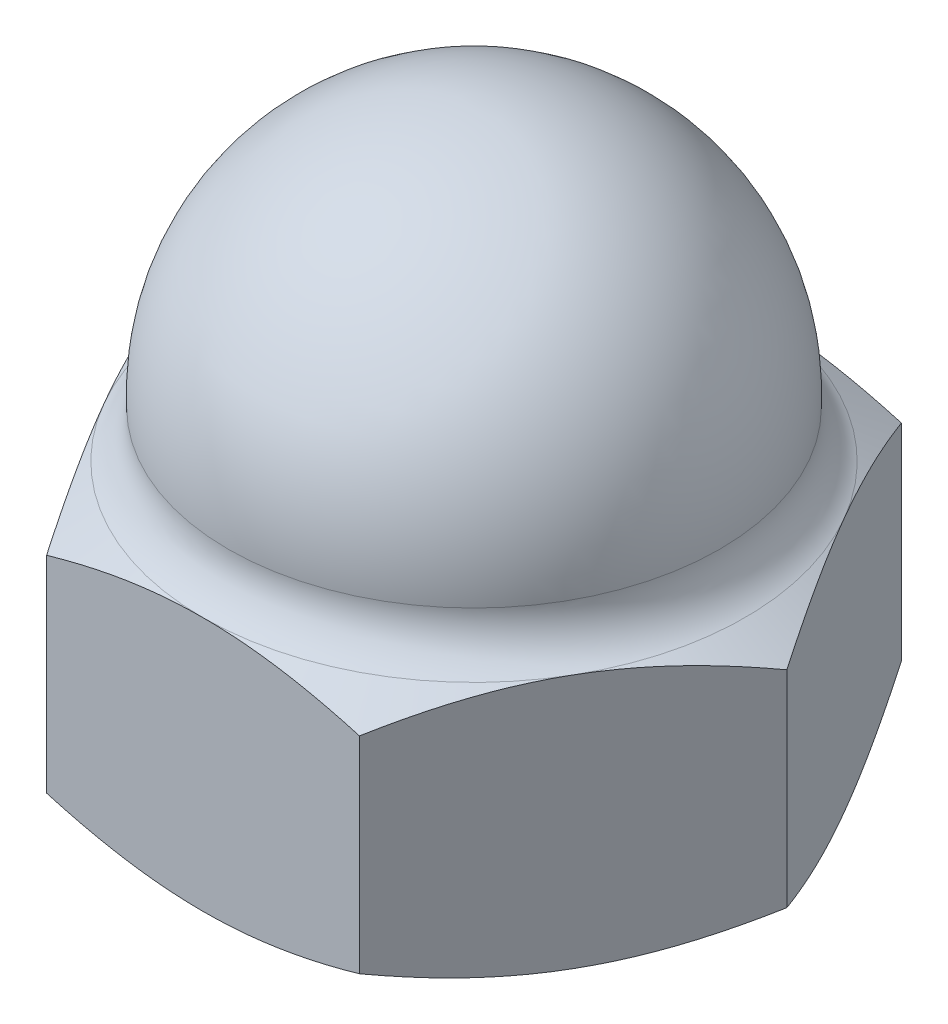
ISO-10303-21;
HEADER;
FILE_DESCRIPTION(('STEP AP214'),'2;1');
FILE_NAME('part.step','',(''),(''),'','','');
FILE_SCHEMA(('AUTOMOTIVE_DESIGN { 1 0 10303 214 1 1 1 1 }'));
ENDSEC;
DATA;
#1=APPLICATION_CONTEXT('core data for automotive mechanical design processes');
#2=APPLICATION_PROTOCOL_DEFINITION('international standard','automotive_design',2000,#1);
#3=PRODUCT_CONTEXT('',#1,'mechanical');
#4=PRODUCT('Part','Part','',(#3));
#5=PRODUCT_RELATED_PRODUCT_CATEGORY('part','',(#4));
#6=PRODUCT_DEFINITION_FORMATION('','',#4);
#7=PRODUCT_DEFINITION_CONTEXT('part definition',#1,'design');
#8=PRODUCT_DEFINITION('design','',#6,#7);
#9=PRODUCT_DEFINITION_SHAPE('','',#8);
#10=(LENGTH_UNIT() NAMED_UNIT(*) SI_UNIT(.MILLI.,.METRE.));
#11=(NAMED_UNIT(*) PLANE_ANGLE_UNIT() SI_UNIT($,.RADIAN.));
#12=(NAMED_UNIT(*) SI_UNIT($,.STERADIAN.) SOLID_ANGLE_UNIT());
#13=UNCERTAINTY_MEASURE_WITH_UNIT(LENGTH_MEASURE(1.E-05),#10,'distance_accuracy_value','');
#14=(GEOMETRIC_REPRESENTATION_CONTEXT(3) GLOBAL_UNCERTAINTY_ASSIGNED_CONTEXT((#13)) GLOBAL_UNIT_ASSIGNED_CONTEXT((#10,
#11,#12)) REPRESENTATION_CONTEXT('',''));
#15=CARTESIAN_POINT('',(0.,0.,0.));
#16=DIRECTION('',(0.,0.,1.));
#17=DIRECTION('',(1.,0.,0.));
#18=AXIS2_PLACEMENT_3D('',#15,#16,#17);
#19=CARTESIAN_POINT('',(0.,0.,0.));
#20=DIRECTION('',(0.,1.,0.));
#21=DIRECTION('',(0.,0.,1.));
#22=AXIS2_PLACEMENT_3D('',#19,#20,#21);
#23=CONICAL_SURFACE('',#22,8.,1.04719754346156);
#24=CARTESIAN_POINT('',(4.61868668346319,0.714597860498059,8.0002));
#25=CARTESIAN_POINT('',(4.72021302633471,0.655990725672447,7.82435121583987));
#26=CARTESIAN_POINT('',(4.82211789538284,0.600043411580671,7.64784680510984));
#27=CARTESIAN_POINT('',(5.02675523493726,0.494201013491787,7.29340453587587));
#28=CARTESIAN_POINT('',(5.12948804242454,0.444308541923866,7.11546609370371));
#29=CARTESIAN_POINT('',(5.43933134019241,0.304692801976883,6.57880175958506));
#30=CARTESIAN_POINT('',(5.64766492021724,0.225281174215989,6.21795741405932));
#31=CARTESIAN_POINT('',(5.95943209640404,0.13216164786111,5.67796082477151));
#32=CARTESIAN_POINT('',(6.06193429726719,0.105634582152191,5.5004218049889));
#33=CARTESIAN_POINT('',(6.26740224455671,0.061153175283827,5.14454088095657));
#34=CARTESIAN_POINT('',(6.37036794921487,0.0431980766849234,4.96619904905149));
#35=CARTESIAN_POINT('',(6.57647664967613,0.0163156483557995,4.6092083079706));
#36=CARTESIAN_POINT('',(6.67961931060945,0.00737807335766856,4.43055997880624));
#37=CARTESIAN_POINT('',(6.88599991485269,-0.00127769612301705,4.07309828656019));
#38=CARTESIAN_POINT('',(6.98923785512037,-0.000996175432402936,3.89428492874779));
#39=CARTESIAN_POINT('',(7.1822450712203,0.00814502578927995,3.55998662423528));
#40=CARTESIAN_POINT('',(7.27202796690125,0.0158896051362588,3.40447808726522));
#41=CARTESIAN_POINT('',(7.45138347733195,0.0382011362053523,3.09382523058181));
#42=CARTESIAN_POINT('',(7.54095607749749,0.0527685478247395,2.93868093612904));
#43=CARTESIAN_POINT('',(7.80932710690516,0.106360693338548,2.47384867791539));
#44=CARTESIAN_POINT('',(7.98765049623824,0.155268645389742,2.1649835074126));
#45=CARTESIAN_POINT('',(8.34618890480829,0.27753940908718,1.54397676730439));
#46=CARTESIAN_POINT('',(8.52635816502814,0.351420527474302,1.23191445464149));
#47=CARTESIAN_POINT('',(8.88400987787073,0.519100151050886,0.612443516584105));
#48=CARTESIAN_POINT('',(9.06149691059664,0.612859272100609,0.305026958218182));
#49=CARTESIAN_POINT('',(9.23771977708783,0.714597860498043,-0.00019999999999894));
#50=B_SPLINE_CURVE_WITH_KNOTS('',3,(#24,#25,#26,#27,#28,#29,#30,#31,#32,#33,#34,#35,#36,#37,#38,
#39,#40,#41,#42,#43,#44,#45,#46,#47,#48,#49),.UNSPECIFIED.,.F.,.F.,(4,2,2,2,2,2,2,2,2,2,2,2,4),
(0.,0.633973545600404,1.2682196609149,2.53934713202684,3.15934344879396,3.77928497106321,
4.39852135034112,5.01773859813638,5.55680240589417,6.09590255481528,7.17487078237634,
8.27776850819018,9.37850115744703),.UNSPECIFIED.);
#51=CARTESIAN_POINT('',(4.61880215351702,0.714531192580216,8.));
#52=VERTEX_POINT('',#51);
#53=CARTESIAN_POINT('',(6.92820323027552,0.,3.99999999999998));
#54=VERTEX_POINT('',#53);
#55=EDGE_CURVE('E255',#52,#54,#50,.T.);
#56=ORIENTED_EDGE('',*,*,#55,.F.);
#57=CARTESIAN_POINT('',(-12.4167804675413,3.90912140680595,8.));
#58=CARTESIAN_POINT('',(-12.067290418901,3.73954675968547,8.));
#59=CARTESIAN_POINT('',(-11.716999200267,3.57159510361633,8.));
#60=CARTESIAN_POINT('',(-11.0143884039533,3.23985034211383,8.));
#61=CARTESIAN_POINT('',(-10.6620685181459,3.07605789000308,8.));
#62=CARTESIAN_POINT('',(-9.9531638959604,2.75272220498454,8.));
#63=CARTESIAN_POINT('',(-9.59656638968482,2.59320687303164,8.));
#64=CARTESIAN_POINT('',(-8.88053881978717,2.28069032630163,8.));
#65=CARTESIAN_POINT('',(-8.52110889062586,2.12768880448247,8.));
#66=CARTESIAN_POINT('',(-7.78718797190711,1.82511354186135,8.));
#67=CARTESIAN_POINT('',(-7.41258514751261,1.67580956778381,8.));
#68=CARTESIAN_POINT('',(-6.65900149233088,1.38847696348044,8.));
#69=CARTESIAN_POINT('',(-6.28002017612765,1.25044959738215,8.));
#70=CARTESIAN_POINT('',(-5.51777815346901,0.989286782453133,8.));
#71=CARTESIAN_POINT('',(-5.13452785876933,0.866121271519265,8.));
#72=CARTESIAN_POINT('',(-4.36254331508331,0.638626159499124,8.));
#73=CARTESIAN_POINT('',(-3.9738108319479,0.534290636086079,8.));
#74=CARTESIAN_POINT('',(-3.19274509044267,0.350020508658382,8.));
#75=CARTESIAN_POINT('',(-2.80044412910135,0.269952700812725,8.));
#76=CARTESIAN_POINT('',(-2.2084120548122,0.171510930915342,8.));
#77=CARTESIAN_POINT('',(-2.01045675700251,0.142305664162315,8.));
#78=CARTESIAN_POINT('',(-1.61355877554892,0.0916877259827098,8.));
#79=CARTESIAN_POINT('',(-1.41461618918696,0.0702743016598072,8.));
#80=CARTESIAN_POINT('',(-1.01861322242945,0.0359357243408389,8.));
#81=CARTESIAN_POINT('',(-0.821562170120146,0.0229034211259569,8.));
#82=CARTESIAN_POINT('',(-0.427085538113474,0.00518384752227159,8.));
#83=CARTESIAN_POINT('',(-0.229659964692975,0.000496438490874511,8.));
#84=CARTESIAN_POINT('',(0.165212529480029,-0.000421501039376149,8.));
#85=CARTESIAN_POINT('',(0.362659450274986,0.00334798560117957,8.));
#86=CARTESIAN_POINT('',(0.75721862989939,0.0192515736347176,8.));
#87=CARTESIAN_POINT('',(0.954330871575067,0.0313860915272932,8.));
#88=CARTESIAN_POINT('',(1.42775544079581,0.0703196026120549,8.));
#89=CARTESIAN_POINT('',(1.70374960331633,0.101071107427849,8.));
#90=CARTESIAN_POINT('',(2.2536830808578,0.177298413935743,8.));
#91=CARTESIAN_POINT('',(2.52762211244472,0.222776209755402,8.));
#92=CARTESIAN_POINT('',(3.34604788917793,0.378887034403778,8.));
#93=CARTESIAN_POINT('',(3.88683594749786,0.509168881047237,8.));
#94=CARTESIAN_POINT('',(4.69544514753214,0.735008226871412,8.));
#95=CARTESIAN_POINT('',(4.96746291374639,0.816403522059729,8.));
#96=CARTESIAN_POINT('',(5.50885646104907,0.987629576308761,8.));
#97=CARTESIAN_POINT('',(5.77823222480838,1.07746039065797,8.));
#98=CARTESIAN_POINT('',(6.31442655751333,1.26411776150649,8.));
#99=CARTESIAN_POINT('',(6.58124594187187,1.36094199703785,8.));
#100=CARTESIAN_POINT('',(7.11267558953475,1.56044886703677,8.));
#101=CARTESIAN_POINT('',(7.3772858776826,1.66313143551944,8.));
#102=CARTESIAN_POINT('',(7.99738806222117,1.91040587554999,8.));
#103=CARTESIAN_POINT('',(8.35207087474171,2.05702285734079,8.));
#104=CARTESIAN_POINT('',(9.0584471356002,2.35730974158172,8.));
#105=CARTESIAN_POINT('',(9.41014040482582,2.51098006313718,8.));
#106=CARTESIAN_POINT('',(10.1110880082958,2.82397393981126,8.));
#107=CARTESIAN_POINT('',(10.4603417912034,2.98329872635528,8.));
#108=CARTESIAN_POINT('',(11.1567364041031,3.30647150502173,8.));
#109=CARTESIAN_POINT('',(11.503877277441,3.47031940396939,8.));
#110=CARTESIAN_POINT('',(12.1967661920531,3.80187654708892,8.));
#111=CARTESIAN_POINT('',(12.5425123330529,3.96958975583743,8.));
#112=CARTESIAN_POINT('',(13.2325145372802,4.30805667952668,8.));
#113=CARTESIAN_POINT('',(13.5767705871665,4.47881042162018,8.));
#114=CARTESIAN_POINT('',(14.6075665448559,4.99478520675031,8.));
#115=CARTESIAN_POINT('',(15.2922253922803,5.34376377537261,8.));
#116=CARTESIAN_POINT('',(16.6012395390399,6.01954126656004,8.));
#117=CARTESIAN_POINT('',(17.2258859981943,6.34577871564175,8.));
#118=CARTESIAN_POINT('',(18.4728402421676,7.00274168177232,8.));
#119=CARTESIAN_POINT('',(19.0951479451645,7.33346735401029,8.));
#120=CARTESIAN_POINT('',(20.3364009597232,7.99752000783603,8.));
#121=CARTESIAN_POINT('',(20.9553507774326,8.33083857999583,8.));
#122=CARTESIAN_POINT('',(22.1917522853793,9.00016359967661,8.));
#123=CARTESIAN_POINT('',(22.8092040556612,9.33616989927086,8.));
#124=CARTESIAN_POINT('',(23.4261032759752,9.67318079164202,8.));
#125=B_SPLINE_CURVE_WITH_KNOTS('',3,(#57,#58,#59,#60,#61,#62,#63,#64,#65,#66,#67,#68,#69,#70,
#71,#72,#73,#74,#75,#76,#77,#78,#79,#80,#81,#82,#83,#84,#85,#86,#87,#88,#89,#90,#91,#92,#93,#94,
#95,#96,#97,#98,#99,#100,#101,#102,#103,#104,#105,#106,#107,#108,#109,#110,#111,#112,#113,#114,
#115,#116,#117,#118,#119,#120,#121,#122,#123,#124),.UNSPECIFIED.,.F.,.F.,(4,2,2,2,2,2,2,2,2,2,2,
2,2,2,2,2,2,2,2,2,2,2,2,2,2,2,2,2,2,2,2,2,2,4),(0.,1.16538523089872,2.33095240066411,
3.50284826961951,4.67468883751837,5.88432916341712,7.09410490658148,8.30139100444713,
9.50829672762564,10.7084525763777,11.308617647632,11.9087247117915,12.5009984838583,
13.0932624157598,13.685527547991,14.2778221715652,15.1104579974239,15.9432066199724,
17.6096258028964,18.4613586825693,19.3130971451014,20.1645542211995,21.0160017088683,
22.1672759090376,23.3186186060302,24.4702135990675,25.6217848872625,26.7745950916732,
27.9274155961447,30.2327530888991,32.3468591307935,34.4610384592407,36.5700125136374,
38.6788712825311),.UNSPECIFIED.);
#126=CARTESIAN_POINT('',(0.,0.,8.));
#127=VERTEX_POINT('',#126);
#128=EDGE_CURVE('E210',#127,#52,#125,.T.);
#129=ORIENTED_EDGE('',*,*,#128,.F.);
#130=CARTESIAN_POINT('',(0.,0.,0.));
#131=DIRECTION('',(0.,-1.,0.));
#132=DIRECTION('',(0.,0.,-1.));
#133=AXIS2_PLACEMENT_3D('',#130,#131,#132);
#134=CIRCLE('',#133,8.);
#135=EDGE_CURVE('E302',#54,#127,#134,.T.);
#136=ORIENTED_EDGE('',*,*,#135,.F.);
#137=EDGE_LOOP('',(#56,#129,#136));
#138=FACE_BOUND('',#137,.T.);
#139=ADVANCED_FACE('F35',(#138),#23,.T.);
#140=CARTESIAN_POINT('',(9.237604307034,0.714531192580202,0.));
#141=VERTEX_POINT('',#140);
#142=EDGE_CURVE('E244',#54,#141,#50,.T.);
#143=ORIENTED_EDGE('',*,*,#142,.F.);
#144=CARTESIAN_POINT('',(6.92820323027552,0.,-3.99999999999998));
#145=VERTEX_POINT('',#144);
#146=EDGE_CURVE('E267',#145,#54,#134,.T.);
#147=ORIENTED_EDGE('',*,*,#146,.F.);
#148=CARTESIAN_POINT('',(9.23771977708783,0.714597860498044,0.000199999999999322));
#149=CARTESIAN_POINT('',(9.13619343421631,0.655990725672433,-0.175648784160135));
#150=CARTESIAN_POINT('',(9.03428856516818,0.600043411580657,-0.35215319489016));
#151=CARTESIAN_POINT('',(8.82965122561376,0.494201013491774,-0.70659546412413));
#152=CARTESIAN_POINT('',(8.72691841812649,0.444308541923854,-0.88453390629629));
#153=CARTESIAN_POINT('',(8.41707512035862,0.304692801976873,-1.42119824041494));
#154=CARTESIAN_POINT('',(8.20874154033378,0.22528117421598,-1.78204258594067));
#155=CARTESIAN_POINT('',(7.89697436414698,0.132161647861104,-2.32203917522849));
#156=CARTESIAN_POINT('',(7.79447216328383,0.105634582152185,-2.4995781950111));
#157=CARTESIAN_POINT('',(7.58900421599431,0.0611531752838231,-2.85545911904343));
#158=CARTESIAN_POINT('',(7.48603851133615,0.0431980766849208,-3.0338009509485));
#159=CARTESIAN_POINT('',(7.2799298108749,0.016315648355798,-3.39079169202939));
#160=CARTESIAN_POINT('',(7.17678714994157,0.00737807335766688,-3.56944002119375));
#161=CARTESIAN_POINT('',(6.97040654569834,-0.00127769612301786,-3.9269017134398));
#162=CARTESIAN_POINT('',(6.86716860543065,-0.000996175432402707,-4.1057150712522));
#163=CARTESIAN_POINT('',(6.67416138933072,0.00814502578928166,-4.44001337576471));
#164=CARTESIAN_POINT('',(6.58437849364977,0.015889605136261,-4.59552191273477));
#165=CARTESIAN_POINT('',(6.40502298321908,0.0382011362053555,-4.90617476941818));
#166=CARTESIAN_POINT('',(6.31545038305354,0.0527685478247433,-5.06131906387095));
#167=CARTESIAN_POINT('',(6.04707935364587,0.106360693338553,-5.52615132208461));
#168=CARTESIAN_POINT('',(5.86875596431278,0.155268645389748,-5.83501649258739));
#169=CARTESIAN_POINT('',(5.51021755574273,0.277539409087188,-6.45602323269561));
#170=CARTESIAN_POINT('',(5.33004829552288,0.351420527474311,-6.76808554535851));
#171=CARTESIAN_POINT('',(4.97239658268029,0.519100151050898,-7.3875564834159));
#172=CARTESIAN_POINT('',(4.79490954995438,0.612859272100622,-7.69497304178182));
#173=CARTESIAN_POINT('',(4.61868668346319,0.714597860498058,-8.0002));
#174=B_SPLINE_CURVE_WITH_KNOTS('',3,(#148,#149,#150,#151,#152,#153,#154,#155,#156,#157,#158,
#159,#160,#161,#162,#163,#164,#165,#166,#167,#168,#169,#170,#171,#172,#173),.UNSPECIFIED.,.F.,
.F.,(4,2,2,2,2,2,2,2,2,2,2,2,4),(0.,0.633973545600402,1.2682196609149,2.53934713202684,
3.15934344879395,3.77928497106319,4.39852135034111,5.01773859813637,5.55680240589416,
6.09590255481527,7.17487078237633,8.27776850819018,9.37850115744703),.UNSPECIFIED.);
#175=EDGE_CURVE('E224',#141,#145,#174,.T.);
#176=ORIENTED_EDGE('',*,*,#175,.F.);
#177=EDGE_LOOP('',(#143,#147,#176));
#178=FACE_BOUND('',#177,.T.);
#179=ADVANCED_FACE('F291',(#178),#23,.T.);
#180=CARTESIAN_POINT('',(4.61880215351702,0.714531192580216,-8.));
#181=VERTEX_POINT('',#180);
#182=EDGE_CURVE('E219',#145,#181,#174,.T.);
#183=ORIENTED_EDGE('',*,*,#182,.F.);
#184=CARTESIAN_POINT('',(0.,0.,-8.));
#185=VERTEX_POINT('',#184);
#186=EDGE_CURVE('E263',#185,#145,#134,.T.);
#187=ORIENTED_EDGE('',*,*,#186,.F.);
#188=CARTESIAN_POINT('',(-12.4167804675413,3.90912140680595,-8.));
#189=CARTESIAN_POINT('',(-12.067290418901,3.73954675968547,-8.));
#190=CARTESIAN_POINT('',(-11.716999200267,3.57159510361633,-8.));
#191=CARTESIAN_POINT('',(-11.0143884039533,3.23985034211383,-8.));
#192=CARTESIAN_POINT('',(-10.6620685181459,3.07605789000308,-8.));
#193=CARTESIAN_POINT('',(-9.9531638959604,2.75272220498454,-8.));
#194=CARTESIAN_POINT('',(-9.59656638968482,2.59320687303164,-8.));
#195=CARTESIAN_POINT('',(-8.88053881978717,2.28069032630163,-8.));
#196=CARTESIAN_POINT('',(-8.52110889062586,2.12768880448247,-8.));
#197=CARTESIAN_POINT('',(-7.78718797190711,1.82511354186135,-8.));
#198=CARTESIAN_POINT('',(-7.41258514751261,1.67580956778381,-8.));
#199=CARTESIAN_POINT('',(-6.65900149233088,1.38847696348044,-8.));
#200=CARTESIAN_POINT('',(-6.28002017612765,1.25044959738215,-8.));
#201=CARTESIAN_POINT('',(-5.51777815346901,0.989286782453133,-8.));
#202=CARTESIAN_POINT('',(-5.13452785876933,0.866121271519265,-8.));
#203=CARTESIAN_POINT('',(-4.36254331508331,0.638626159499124,-8.));
#204=CARTESIAN_POINT('',(-3.9738108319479,0.534290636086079,-8.));
#205=CARTESIAN_POINT('',(-3.19274509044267,0.350020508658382,-8.));
#206=CARTESIAN_POINT('',(-2.80044412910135,0.269952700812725,-8.));
#207=CARTESIAN_POINT('',(-2.2084120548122,0.171510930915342,-8.));
#208=CARTESIAN_POINT('',(-2.01045675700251,0.142305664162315,-8.));
#209=CARTESIAN_POINT('',(-1.61355877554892,0.0916877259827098,-8.));
#210=CARTESIAN_POINT('',(-1.41461618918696,0.0702743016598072,-8.));
#211=CARTESIAN_POINT('',(-1.01861322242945,0.0359357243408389,-8.));
#212=CARTESIAN_POINT('',(-0.821562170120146,0.0229034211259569,-8.));
#213=CARTESIAN_POINT('',(-0.427085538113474,0.00518384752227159,-8.));
#214=CARTESIAN_POINT('',(-0.229659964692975,0.000496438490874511,-8.));
#215=CARTESIAN_POINT('',(0.165212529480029,-0.000421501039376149,-8.));
#216=CARTESIAN_POINT('',(0.362659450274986,0.00334798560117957,-8.));
#217=CARTESIAN_POINT('',(0.75721862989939,0.0192515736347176,-8.));
#218=CARTESIAN_POINT('',(0.954330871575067,0.0313860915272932,-8.));
#219=CARTESIAN_POINT('',(1.42775544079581,0.0703196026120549,-8.));
#220=CARTESIAN_POINT('',(1.70374960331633,0.101071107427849,-8.));
#221=CARTESIAN_POINT('',(2.2536830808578,0.177298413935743,-8.));
#222=CARTESIAN_POINT('',(2.52762211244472,0.222776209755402,-8.));
#223=CARTESIAN_POINT('',(3.34604788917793,0.378887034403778,-8.));
#224=CARTESIAN_POINT('',(3.88683594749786,0.509168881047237,-8.));
#225=CARTESIAN_POINT('',(4.69544514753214,0.735008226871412,-8.));
#226=CARTESIAN_POINT('',(4.96746291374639,0.816403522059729,-8.));
#227=CARTESIAN_POINT('',(5.50885646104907,0.987629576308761,-8.));
#228=CARTESIAN_POINT('',(5.77823222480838,1.07746039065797,-8.));
#229=CARTESIAN_POINT('',(6.31442655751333,1.26411776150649,-8.));
#230=CARTESIAN_POINT('',(6.58124594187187,1.36094199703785,-8.));
#231=CARTESIAN_POINT('',(7.11267558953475,1.56044886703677,-8.));
#232=CARTESIAN_POINT('',(7.3772858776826,1.66313143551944,-8.));
#233=CARTESIAN_POINT('',(7.99738806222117,1.91040587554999,-8.));
#234=CARTESIAN_POINT('',(8.35207087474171,2.05702285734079,-8.));
#235=CARTESIAN_POINT('',(9.0584471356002,2.35730974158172,-8.));
#236=CARTESIAN_POINT('',(9.41014040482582,2.51098006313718,-8.));
#237=CARTESIAN_POINT('',(10.1110880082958,2.82397393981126,-8.));
#238=CARTESIAN_POINT('',(10.4603417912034,2.98329872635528,-8.));
#239=CARTESIAN_POINT('',(11.1567364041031,3.30647150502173,-8.));
#240=CARTESIAN_POINT('',(11.503877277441,3.47031940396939,-8.));
#241=CARTESIAN_POINT('',(12.1967661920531,3.80187654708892,-8.));
#242=CARTESIAN_POINT('',(12.5425123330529,3.96958975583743,-8.));
#243=CARTESIAN_POINT('',(13.2325145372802,4.30805667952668,-8.));
#244=CARTESIAN_POINT('',(13.5767705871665,4.47881042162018,-8.));
#245=CARTESIAN_POINT('',(14.6075665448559,4.99478520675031,-8.));
#246=CARTESIAN_POINT('',(15.2922253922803,5.34376377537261,-8.));
#247=CARTESIAN_POINT('',(16.6012395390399,6.01954126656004,-8.));
#248=CARTESIAN_POINT('',(17.2258859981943,6.34577871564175,-8.));
#249=CARTESIAN_POINT('',(18.4728402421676,7.00274168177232,-8.));
#250=CARTESIAN_POINT('',(19.0951479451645,7.33346735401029,-8.));
#251=CARTESIAN_POINT('',(20.3364009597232,7.99752000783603,-8.));
#252=CARTESIAN_POINT('',(20.9553507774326,8.33083857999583,-8.));
#253=CARTESIAN_POINT('',(22.1917522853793,9.00016359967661,-8.));
#254=CARTESIAN_POINT('',(22.8092040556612,9.33616989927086,-8.));
#255=CARTESIAN_POINT('',(23.4261032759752,9.67318079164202,-8.));
#256=B_SPLINE_CURVE_WITH_KNOTS('',3,(#188,#189,#190,#191,#192,#193,#194,#195,#196,#197,#198,
#199,#200,#201,#202,#203,#204,#205,#206,#207,#208,#209,#210,#211,#212,#213,#214,#215,#216,#217,
#218,#219,#220,#221,#222,#223,#224,#225,#226,#227,#228,#229,#230,#231,#232,#233,#234,#235,#236,
#237,#238,#239,#240,#241,#242,#243,#244,#245,#246,#247,#248,#249,#250,#251,#252,#253,#254,#255),
.UNSPECIFIED.,.F.,.F.,(4,2,2,2,2,2,2,2,2,2,2,2,2,2,2,2,2,2,2,2,2,2,2,2,2,2,2,2,2,2,2,2,2,4),(0.,
1.16538523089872,2.33095240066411,3.50284826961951,4.67468883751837,5.88432916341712,
7.09410490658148,8.30139100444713,9.50829672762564,10.7084525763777,11.308617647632,
11.9087247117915,12.5009984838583,13.0932624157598,13.685527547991,14.2778221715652,
15.1104579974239,15.9432066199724,17.6096258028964,18.4613586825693,19.3130971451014,
20.1645542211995,21.0160017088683,22.1672759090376,23.3186186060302,24.4702135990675,
25.6217848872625,26.7745950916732,27.9274155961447,30.2327530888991,32.3468591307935,
34.4610384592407,36.5700125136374,38.6788712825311),.UNSPECIFIED.);
#257=EDGE_CURVE('E193',#181,#185,#256,.F.);
#258=ORIENTED_EDGE('',*,*,#257,.F.);
#259=EDGE_LOOP('',(#183,#187,#258));
#260=FACE_BOUND('',#259,.T.);
#261=ADVANCED_FACE('F296',(#260),#23,.T.);
#262=CARTESIAN_POINT('',(-4.61880215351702,0.714531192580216,-8.));
#263=VERTEX_POINT('',#262);
#264=EDGE_CURVE('E188',#185,#263,#256,.F.);
#265=ORIENTED_EDGE('',*,*,#264,.F.);
#266=CARTESIAN_POINT('',(-6.92820323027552,0.,-3.99999999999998));
#267=VERTEX_POINT('',#266);
#268=EDGE_CURVE('E262',#267,#185,#134,.T.);
#269=ORIENTED_EDGE('',*,*,#268,.F.);
#270=CARTESIAN_POINT('',(-4.61868668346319,0.714597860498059,-8.0002));
#271=CARTESIAN_POINT('',(-4.72021302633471,0.655990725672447,-7.82435121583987));
#272=CARTESIAN_POINT('',(-4.82211789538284,0.600043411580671,-7.64784680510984));
#273=CARTESIAN_POINT('',(-5.02675523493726,0.494201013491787,-7.29340453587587));
#274=CARTESIAN_POINT('',(-5.12948804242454,0.444308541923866,-7.11546609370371));
#275=CARTESIAN_POINT('',(-5.43933134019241,0.304692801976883,-6.57880175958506));
#276=CARTESIAN_POINT('',(-5.64766492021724,0.225281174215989,-6.21795741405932));
#277=CARTESIAN_POINT('',(-5.95943209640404,0.13216164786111,-5.67796082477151));
#278=CARTESIAN_POINT('',(-6.06193429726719,0.10563458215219,-5.5004218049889));
#279=CARTESIAN_POINT('',(-6.26740224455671,0.0611531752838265,-5.14454088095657));
#280=CARTESIAN_POINT('',(-6.37036794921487,0.0431980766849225,-4.96619904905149));
#281=CARTESIAN_POINT('',(-6.57647664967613,0.0163156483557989,-4.6092083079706));
#282=CARTESIAN_POINT('',(-6.67961931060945,0.00737807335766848,-4.43055997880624));
#283=CARTESIAN_POINT('',(-6.88599991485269,-0.00127769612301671,-4.07309828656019));
#284=CARTESIAN_POINT('',(-6.98923785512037,-0.00099617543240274,-3.89428492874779));
#285=CARTESIAN_POINT('',(-7.1822450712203,0.00814502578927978,-3.55998662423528));
#286=CARTESIAN_POINT('',(-7.27202796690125,0.0158896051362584,-3.40447808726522));
#287=CARTESIAN_POINT('',(-7.45138347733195,0.0382011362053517,-3.09382523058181));
#288=CARTESIAN_POINT('',(-7.54095607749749,0.052768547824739,-2.93868093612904));
#289=CARTESIAN_POINT('',(-7.80932710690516,0.106360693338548,-2.47384867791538));
#290=CARTESIAN_POINT('',(-7.98765049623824,0.155268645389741,-2.1649835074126));
#291=CARTESIAN_POINT('',(-8.34618890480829,0.277539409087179,-1.54397676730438));
#292=CARTESIAN_POINT('',(-8.52635816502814,0.351420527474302,-1.23191445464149));
#293=CARTESIAN_POINT('',(-8.88400987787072,0.519100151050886,-0.612443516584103));
#294=CARTESIAN_POINT('',(-9.06149691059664,0.612859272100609,-0.30502695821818));
#295=CARTESIAN_POINT('',(-9.23771977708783,0.714597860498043,0.000200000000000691));
#296=B_SPLINE_CURVE_WITH_KNOTS('',3,(#270,#271,#272,#273,#274,#275,#276,#277,#278,#279,#280,
#281,#282,#283,#284,#285,#286,#287,#288,#289,#290,#291,#292,#293,#294,#295),.UNSPECIFIED.,.F.,
.F.,(4,2,2,2,2,2,2,2,2,2,2,2,4),(0.,0.633973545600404,1.2682196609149,2.53934713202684,
3.15934344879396,3.7792849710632,4.39852135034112,5.01773859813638,5.55680240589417,
6.09590255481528,7.17487078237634,8.27776850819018,9.37850115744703),.UNSPECIFIED.);
#297=EDGE_CURVE('E148',#263,#267,#296,.T.);
#298=ORIENTED_EDGE('',*,*,#297,.F.);
#299=EDGE_LOOP('',(#265,#269,#298));
#300=FACE_BOUND('',#299,.T.);
#301=ADVANCED_FACE('F508',(#300),#23,.T.);
#302=CARTESIAN_POINT('',(-9.237604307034,0.714531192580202,0.));
#303=VERTEX_POINT('',#302);
#304=EDGE_CURVE('E145',#267,#303,#296,.T.);
#305=ORIENTED_EDGE('',*,*,#304,.F.);
#306=CARTESIAN_POINT('',(-6.92820323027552,0.,3.99999999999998));
#307=VERTEX_POINT('',#306);
#308=EDGE_CURVE('E326',#307,#267,#134,.T.);
#309=ORIENTED_EDGE('',*,*,#308,.F.);
#310=CARTESIAN_POINT('',(-9.23771977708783,0.714597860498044,-0.000199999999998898));
#311=CARTESIAN_POINT('',(-9.13619343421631,0.655990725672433,0.175648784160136));
#312=CARTESIAN_POINT('',(-9.03428856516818,0.600043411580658,0.352153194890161));
#313=CARTESIAN_POINT('',(-8.82965122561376,0.494201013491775,0.706595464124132));
#314=CARTESIAN_POINT('',(-8.72691841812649,0.444308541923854,0.884533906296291));
#315=CARTESIAN_POINT('',(-8.41707512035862,0.304692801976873,1.42119824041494));
#316=CARTESIAN_POINT('',(-8.20874154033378,0.225281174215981,1.78204258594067));
#317=CARTESIAN_POINT('',(-7.89697436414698,0.132161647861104,2.32203917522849));
#318=CARTESIAN_POINT('',(-7.79447216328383,0.105634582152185,2.4995781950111));
#319=CARTESIAN_POINT('',(-7.58900421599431,0.0611531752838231,2.85545911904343));
#320=CARTESIAN_POINT('',(-7.48603851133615,0.0431980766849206,3.0338009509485));
#321=CARTESIAN_POINT('',(-7.2799298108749,0.0163156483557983,3.39079169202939));
#322=CARTESIAN_POINT('',(-7.17678714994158,0.00737807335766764,3.56944002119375));
#323=CARTESIAN_POINT('',(-6.97040654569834,-0.00127769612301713,3.9269017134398));
#324=CARTESIAN_POINT('',(-6.86716860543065,-0.000996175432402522,4.1057150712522));
#325=CARTESIAN_POINT('',(-6.67416138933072,0.0081450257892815,4.44001337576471));
#326=CARTESIAN_POINT('',(-6.58437849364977,0.015889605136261,4.59552191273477));
#327=CARTESIAN_POINT('',(-6.40502298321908,0.0382011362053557,4.90617476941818));
#328=CARTESIAN_POINT('',(-6.31545038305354,0.0527685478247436,5.06131906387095));
#329=CARTESIAN_POINT('',(-6.04707935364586,0.106360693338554,5.52615132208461));
#330=CARTESIAN_POINT('',(-5.86875596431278,0.155268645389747,5.83501649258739));
#331=CARTESIAN_POINT('',(-5.51021755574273,0.277539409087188,6.45602323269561));
#332=CARTESIAN_POINT('',(-5.33004829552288,0.351420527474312,6.76808554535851));
#333=CARTESIAN_POINT('',(-4.97239658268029,0.519100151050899,7.3875564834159));
#334=CARTESIAN_POINT('',(-4.79490954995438,0.612859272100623,7.69497304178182));
#335=CARTESIAN_POINT('',(-4.61868668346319,0.714597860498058,8.0002));
#336=B_SPLINE_CURVE_WITH_KNOTS('',3,(#310,#311,#312,#313,#314,#315,#316,#317,#318,#319,#320,
#321,#322,#323,#324,#325,#326,#327,#328,#329,#330,#331,#332,#333,#334,#335),.UNSPECIFIED.,.F.,
.F.,(4,2,2,2,2,2,2,2,2,2,2,2,4),(0.,0.633973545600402,1.2682196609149,2.53934713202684,
3.15934344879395,3.77928497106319,4.39852135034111,5.01773859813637,5.55680240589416,
6.09590255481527,7.17487078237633,8.27776850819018,9.37850115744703),.UNSPECIFIED.);
#337=EDGE_CURVE('E150',#303,#307,#336,.T.);
#338=ORIENTED_EDGE('',*,*,#337,.F.);
#339=EDGE_LOOP('',(#305,#309,#338));
#340=FACE_BOUND('',#339,.T.);
#341=ADVANCED_FACE('F204',(#340),#23,.T.);
#342=CARTESIAN_POINT('',(-4.61880215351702,0.714531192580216,8.));
#343=VERTEX_POINT('',#342);
#344=EDGE_CURVE('E139',#307,#343,#336,.T.);
#345=ORIENTED_EDGE('',*,*,#344,.F.);
#346=EDGE_CURVE('E330',#127,#307,#134,.T.);
#347=ORIENTED_EDGE('',*,*,#346,.F.);
#348=EDGE_CURVE('E57',#343,#127,#125,.T.);
#349=ORIENTED_EDGE('',*,*,#348,.F.);
#350=EDGE_LOOP('',(#345,#347,#349));
#351=FACE_BOUND('',#350,.T.);
#352=ADVANCED_FACE('F199',(#351),#23,.T.);
#353=CARTESIAN_POINT('',(8.,0.,0.));
#354=DIRECTION('',(0.,-1.,0.));
#355=DIRECTION('',(0.,0.,-1.));
#356=AXIS2_PLACEMENT_3D('',#353,#354,#355);
#357=PLANE('',#356);
#358=CARTESIAN_POINT('',(0.,0.,0.));
#359=DIRECTION('',(0.,-1.,0.));
#360=DIRECTION('',(1.,0.,0.));
#361=AXIS2_PLACEMENT_3D('',#358,#359,#360);
#362=CIRCLE('',#361,5.);
#363=CARTESIAN_POINT('',(5.,0.,0.));
#364=VERTEX_POINT('',#363);
#365=EDGE_CURVE('E274',#364,#364,#362,.T.);
#366=ORIENTED_EDGE('',*,*,#365,.F.);
#367=EDGE_LOOP('',(#366));
#368=FACE_BOUND('',#367,.T.);
#369=ORIENTED_EDGE('',*,*,#186,.T.);
#370=ORIENTED_EDGE('',*,*,#146,.T.);
#371=ORIENTED_EDGE('',*,*,#135,.T.);
#372=ORIENTED_EDGE('',*,*,#346,.T.);
#373=ORIENTED_EDGE('',*,*,#308,.T.);
#374=ORIENTED_EDGE('',*,*,#268,.T.);
#375=EDGE_LOOP('',(#369,#370,#371,#372,#373,#374));
#376=FACE_BOUND('',#375,.T.);
#377=ADVANCED_FACE('F203',(#368,#376),#357,.T.);
#378=CARTESIAN_POINT('',(4.61880215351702,8.,8.));
#379=DIRECTION('',(-0.86602540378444,0.,-0.499999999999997));
#380=DIRECTION('',(-0.499999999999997,0.,0.86602540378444));
#381=AXIS2_PLACEMENT_3D('',#378,#379,#380);
#382=PLANE('',#381);
#383=CARTESIAN_POINT('',(9.23771977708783,6.79691970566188,-0.000199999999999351));
#384=CARTESIAN_POINT('',(9.13619343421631,6.85552684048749,0.175648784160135));
#385=CARTESIAN_POINT('',(9.03428856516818,6.91147415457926,0.35215319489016));
#386=CARTESIAN_POINT('',(8.82965122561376,7.01731655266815,0.706595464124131));
#387=CARTESIAN_POINT('',(8.72691841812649,7.06720902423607,0.88453390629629));
#388=CARTESIAN_POINT('',(8.41707512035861,7.20682476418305,1.42119824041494));
#389=CARTESIAN_POINT('',(8.20874154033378,7.28623639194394,1.78204258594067));
#390=CARTESIAN_POINT('',(7.89697436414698,7.37935591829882,2.32203917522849));
#391=CARTESIAN_POINT('',(7.79447216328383,7.40588298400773,2.4995781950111));
#392=CARTESIAN_POINT('',(7.58900421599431,7.4503643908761,2.85545911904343));
#393=CARTESIAN_POINT('',(7.48603851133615,7.468319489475,3.0338009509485));
#394=CARTESIAN_POINT('',(7.2799298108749,7.49520191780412,3.39079169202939));
#395=CARTESIAN_POINT('',(7.17678714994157,7.50413949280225,3.56944002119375));
#396=CARTESIAN_POINT('',(6.97040654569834,7.51279526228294,3.9269017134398));
#397=CARTESIAN_POINT('',(6.86716860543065,7.51251374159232,4.1057150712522));
#398=CARTESIAN_POINT('',(6.67416138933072,7.50337254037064,4.44001337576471));
#399=CARTESIAN_POINT('',(6.58437849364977,7.49562796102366,4.59552191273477));
#400=CARTESIAN_POINT('',(6.40502298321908,7.47331642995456,4.90617476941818));
#401=CARTESIAN_POINT('',(6.31545038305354,7.45874901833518,5.06131906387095));
#402=CARTESIAN_POINT('',(6.04707935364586,7.40515687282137,5.52615132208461));
#403=CARTESIAN_POINT('',(5.86875596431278,7.35624892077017,5.83501649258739));
#404=CARTESIAN_POINT('',(5.51021755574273,7.23397815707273,6.45602323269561));
#405=CARTESIAN_POINT('',(5.33004829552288,7.16009703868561,6.76808554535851));
#406=CARTESIAN_POINT('',(4.97239658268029,6.99241741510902,7.3875564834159));
#407=CARTESIAN_POINT('',(4.79490954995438,6.8986582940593,7.69497304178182));
#408=CARTESIAN_POINT('',(4.61868668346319,6.79691970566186,8.0002));
#409=B_SPLINE_CURVE_WITH_KNOTS('',3,(#383,#384,#385,#386,#387,#388,#389,#390,#391,#392,#393,
#394,#395,#396,#397,#398,#399,#400,#401,#402,#403,#404,#405,#406,#407,#408),.UNSPECIFIED.,.F.,
.F.,(4,2,2,2,2,2,2,2,2,2,2,2,4),(0.,0.633973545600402,1.2682196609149,2.53934713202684,
3.15934344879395,3.77928497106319,4.39852135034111,5.01773859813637,5.55680240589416,
6.09590255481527,7.17487078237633,8.27776850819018,9.37850115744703),.UNSPECIFIED.);
#410=CARTESIAN_POINT('',(9.237604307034,6.79698637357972,0.));
#411=VERTEX_POINT('',#410);
#412=CARTESIAN_POINT('',(6.92820323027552,7.51151756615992,3.99999999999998));
#413=VERTEX_POINT('',#412);
#414=EDGE_CURVE('E254',#411,#413,#409,.T.);
#415=ORIENTED_EDGE('',*,*,#414,.T.);
#416=CARTESIAN_POINT('',(4.61880215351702,6.79698637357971,8.));
#417=VERTEX_POINT('',#416);
#418=EDGE_CURVE('E249',#413,#417,#409,.T.);
#419=ORIENTED_EDGE('',*,*,#418,.T.);
#420=DIRECTION('',(0.,-1.,0.));
#421=VECTOR('',#420,1.);
#422=CARTESIAN_POINT('',(4.61880215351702,8.,8.));
#423=LINE('',#422,#421);
#424=EDGE_CURVE('E141',#417,#52,#423,.T.);
#425=ORIENTED_EDGE('',*,*,#424,.T.);
#426=ORIENTED_EDGE('',*,*,#55,.T.);
#427=ORIENTED_EDGE('',*,*,#142,.T.);
#428=DIRECTION('',(0.,-1.,0.));
#429=VECTOR('',#428,1.);
#430=CARTESIAN_POINT('',(9.237604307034,8.,0.));
#431=LINE('',#430,#429);
#432=EDGE_CURVE('E315',#411,#141,#431,.T.);
#433=ORIENTED_EDGE('',*,*,#432,.F.);
#434=EDGE_LOOP('',(#415,#419,#425,#426,#427,#433));
#435=FACE_BOUND('',#434,.T.);
#436=ADVANCED_FACE('F234',(#435),#382,.F.);
#437=CARTESIAN_POINT('',(4.61880215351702,8.,-8.));
#438=DIRECTION('',(-0.86602540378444,0.,0.499999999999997));
#439=DIRECTION('',(0.499999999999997,0.,0.86602540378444));
#440=AXIS2_PLACEMENT_3D('',#437,#438,#439);
#441=PLANE('',#440);
#442=CARTESIAN_POINT('',(4.61868668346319,6.79691970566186,-8.0002));
#443=CARTESIAN_POINT('',(4.72021302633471,6.85552684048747,-7.82435121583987));
#444=CARTESIAN_POINT('',(4.82211789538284,6.91147415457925,-7.64784680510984));
#445=CARTESIAN_POINT('',(5.02675523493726,7.01731655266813,-7.29340453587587));
#446=CARTESIAN_POINT('',(5.12948804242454,7.06720902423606,-7.11546609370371));
#447=CARTESIAN_POINT('',(5.43933134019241,7.20682476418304,-6.57880175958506));
#448=CARTESIAN_POINT('',(5.64766492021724,7.28623639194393,-6.21795741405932));
#449=CARTESIAN_POINT('',(5.95943209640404,7.37935591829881,-5.67796082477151));
#450=CARTESIAN_POINT('',(6.06193429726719,7.40588298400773,-5.5004218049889));
#451=CARTESIAN_POINT('',(6.26740224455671,7.45036439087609,-5.14454088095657));
#452=CARTESIAN_POINT('',(6.37036794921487,7.468319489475,-4.96619904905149));
#453=CARTESIAN_POINT('',(6.57647664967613,7.49520191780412,-4.60920830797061));
#454=CARTESIAN_POINT('',(6.67961931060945,7.50413949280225,-4.43055997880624));
#455=CARTESIAN_POINT('',(6.88599991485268,7.51279526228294,-4.07309828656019));
#456=CARTESIAN_POINT('',(6.98923785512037,7.51251374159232,-3.89428492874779));
#457=CARTESIAN_POINT('',(7.1822450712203,7.50337254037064,-3.55998662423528));
#458=CARTESIAN_POINT('',(7.27202796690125,7.49562796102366,-3.40447808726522));
#459=CARTESIAN_POINT('',(7.45138347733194,7.47331642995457,-3.09382523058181));
#460=CARTESIAN_POINT('',(7.54095607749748,7.45874901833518,-2.93868093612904));
#461=CARTESIAN_POINT('',(7.80932710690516,7.40515687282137,-2.47384867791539));
#462=CARTESIAN_POINT('',(7.98765049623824,7.35624892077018,-2.16498350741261));
#463=CARTESIAN_POINT('',(8.34618890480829,7.23397815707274,-1.54397676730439));
#464=CARTESIAN_POINT('',(8.52635816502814,7.16009703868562,-1.23191445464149));
#465=CARTESIAN_POINT('',(8.88400987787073,6.99241741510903,-0.612443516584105));
#466=CARTESIAN_POINT('',(9.06149691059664,6.89865829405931,-0.305026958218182));
#467=CARTESIAN_POINT('',(9.23771977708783,6.79691970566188,0.000199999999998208));
#468=B_SPLINE_CURVE_WITH_KNOTS('',3,(#442,#443,#444,#445,#446,#447,#448,#449,#450,#451,#452,
#453,#454,#455,#456,#457,#458,#459,#460,#461,#462,#463,#464,#465,#466,#467),.UNSPECIFIED.,.F.,
.F.,(4,2,2,2,2,2,2,2,2,2,2,2,4),(0.,0.633973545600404,1.2682196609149,2.53934713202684,
3.15934344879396,3.7792849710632,4.39852135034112,5.01773859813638,5.55680240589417,
6.09590255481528,7.17487078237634,8.27776850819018,9.37850115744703),.UNSPECIFIED.);
#469=CARTESIAN_POINT('',(4.61880215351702,6.79698637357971,-8.));
#470=VERTEX_POINT('',#469);
#471=CARTESIAN_POINT('',(6.92820323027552,7.51151756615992,-3.99999999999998));
#472=VERTEX_POINT('',#471);
#473=EDGE_CURVE('E306',#470,#472,#468,.T.);
#474=ORIENTED_EDGE('',*,*,#473,.T.);
#475=EDGE_CURVE('E226',#472,#411,#468,.T.);
#476=ORIENTED_EDGE('',*,*,#475,.T.);
#477=ORIENTED_EDGE('',*,*,#432,.T.);
#478=ORIENTED_EDGE('',*,*,#175,.T.);
#479=ORIENTED_EDGE('',*,*,#182,.T.);
#480=DIRECTION('',(0.,-1.,0.));
#481=VECTOR('',#480,1.);
#482=CARTESIAN_POINT('',(4.61880215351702,8.,-8.));
#483=LINE('',#482,#481);
#484=EDGE_CURVE('E340',#470,#181,#483,.T.);
#485=ORIENTED_EDGE('',*,*,#484,.F.);
#486=EDGE_LOOP('',(#474,#476,#477,#478,#479,#485));
#487=FACE_BOUND('',#486,.T.);
#488=ADVANCED_FACE('F230',(#487),#441,.F.);
#489=CARTESIAN_POINT('',(-4.61880215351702,8.,-8.));
#490=DIRECTION('',(0.,0.,1.));
#491=DIRECTION('',(1.,0.,0.));
#492=AXIS2_PLACEMENT_3D('',#489,#490,#491);
#493=PLANE('',#492);
#494=CARTESIAN_POINT('',(-12.4167804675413,3.60239615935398,-8.));
#495=CARTESIAN_POINT('',(-12.067290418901,3.77197080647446,-8.));
#496=CARTESIAN_POINT('',(-11.716999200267,3.9399224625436,-8.));
#497=CARTESIAN_POINT('',(-11.0143884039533,4.2716672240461,-8.));
#498=CARTESIAN_POINT('',(-10.6620685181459,4.43545967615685,-8.));
#499=CARTESIAN_POINT('',(-9.9531638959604,4.75879536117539,-8.));
#500=CARTESIAN_POINT('',(-9.59656638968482,4.91831069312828,-8.));
#501=CARTESIAN_POINT('',(-8.88053881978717,5.2308272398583,-8.));
#502=CARTESIAN_POINT('',(-8.52110889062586,5.38382876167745,-8.));
#503=CARTESIAN_POINT('',(-7.7871879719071,5.68640402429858,-8.));
#504=CARTESIAN_POINT('',(-7.41258514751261,5.83570799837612,-8.));
#505=CARTESIAN_POINT('',(-6.65900149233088,6.12304060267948,-8.));
#506=CARTESIAN_POINT('',(-6.28002017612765,6.26106796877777,-8.));
#507=CARTESIAN_POINT('',(-5.51777815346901,6.52223078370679,-8.));
#508=CARTESIAN_POINT('',(-5.13452785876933,6.64539629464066,-8.));
#509=CARTESIAN_POINT('',(-4.36254331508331,6.8728914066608,-8.));
#510=CARTESIAN_POINT('',(-3.9738108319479,6.97722693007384,-8.));
#511=CARTESIAN_POINT('',(-3.19274509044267,7.16149705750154,-8.));
#512=CARTESIAN_POINT('',(-2.80044412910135,7.2415648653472,-8.));
#513=CARTESIAN_POINT('',(-2.2084120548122,7.34000663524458,-8.));
#514=CARTESIAN_POINT('',(-2.01045675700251,7.36921190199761,-8.));
#515=CARTESIAN_POINT('',(-1.61355877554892,7.41982984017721,-8.));
#516=CARTESIAN_POINT('',(-1.41461618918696,7.44124326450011,-8.));
#517=CARTESIAN_POINT('',(-1.01861322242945,7.47558184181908,-8.));
#518=CARTESIAN_POINT('',(-0.821562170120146,7.48861414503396,-8.));
#519=CARTESIAN_POINT('',(-0.427085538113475,7.50633371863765,-8.));
#520=CARTESIAN_POINT('',(-0.229659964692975,7.51102112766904,-8.));
#521=CARTESIAN_POINT('',(0.165212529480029,7.51193906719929,-8.));
#522=CARTESIAN_POINT('',(0.362659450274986,7.50816958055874,-8.));
#523=CARTESIAN_POINT('',(0.75721862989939,7.4922659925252,-8.));
#524=CARTESIAN_POINT('',(0.954330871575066,7.48013147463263,-8.));
#525=CARTESIAN_POINT('',(1.42775544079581,7.44119796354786,-8.));
#526=CARTESIAN_POINT('',(1.70374960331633,7.41044645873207,-8.));
#527=CARTESIAN_POINT('',(2.2536830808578,7.33421915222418,-8.));
#528=CARTESIAN_POINT('',(2.52762211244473,7.28874135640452,-8.));
#529=CARTESIAN_POINT('',(3.34604788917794,7.13263053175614,-8.));
#530=CARTESIAN_POINT('',(3.88683594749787,7.00234868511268,-8.));
#531=CARTESIAN_POINT('',(4.69544514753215,6.77650933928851,-8.));
#532=CARTESIAN_POINT('',(4.9674629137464,6.69511404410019,-8.));
#533=CARTESIAN_POINT('',(5.50885646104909,6.52388798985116,-8.));
#534=CARTESIAN_POINT('',(5.7782322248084,6.43405717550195,-8.));
#535=CARTESIAN_POINT('',(6.31442655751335,6.24739980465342,-8.));
#536=CARTESIAN_POINT('',(6.58124594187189,6.15057556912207,-8.));
#537=CARTESIAN_POINT('',(7.11267558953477,5.95106869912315,-8.));
#538=CARTESIAN_POINT('',(7.37728587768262,5.84838613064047,-8.));
#539=CARTESIAN_POINT('',(7.99738806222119,5.60111169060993,-8.));
#540=CARTESIAN_POINT('',(8.35207087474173,5.45449470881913,-8.));
#541=CARTESIAN_POINT('',(9.05844713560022,5.15420782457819,-8.));
#542=CARTESIAN_POINT('',(9.41014040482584,5.00053750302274,-8.));
#543=CARTESIAN_POINT('',(10.1110880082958,4.68754362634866,-8.));
#544=CARTESIAN_POINT('',(10.4603417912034,4.52821883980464,-8.));
#545=CARTESIAN_POINT('',(11.1567364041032,4.20504606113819,-8.));
#546=CARTESIAN_POINT('',(11.503877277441,4.04119816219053,-8.));
#547=CARTESIAN_POINT('',(12.1967661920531,3.709641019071,-8.));
#548=CARTESIAN_POINT('',(12.5425123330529,3.54192781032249,-8.));
#549=CARTESIAN_POINT('',(13.2325145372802,3.20346088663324,-8.));
#550=CARTESIAN_POINT('',(13.5767705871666,3.03270714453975,-8.));
#551=CARTESIAN_POINT('',(14.6075665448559,2.51673235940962,-8.));
#552=CARTESIAN_POINT('',(15.2922253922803,2.16775379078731,-8.));
#553=CARTESIAN_POINT('',(16.6012395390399,1.49197629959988,-8.));
#554=CARTESIAN_POINT('',(17.2258859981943,1.16573885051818,-8.));
#555=CARTESIAN_POINT('',(18.4728402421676,0.508775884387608,-8.));
#556=CARTESIAN_POINT('',(19.0951479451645,0.178050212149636,-8.));
#557=CARTESIAN_POINT('',(20.3364009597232,-0.486002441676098,-8.));
#558=CARTESIAN_POINT('',(20.9553507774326,-0.819321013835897,-8.));
#559=CARTESIAN_POINT('',(22.1917522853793,-1.48864603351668,-8.));
#560=CARTESIAN_POINT('',(22.8092040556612,-1.82465233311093,-8.));
#561=CARTESIAN_POINT('',(23.4261032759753,-2.16166322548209,-8.));
#562=B_SPLINE_CURVE_WITH_KNOTS('',3,(#494,#495,#496,#497,#498,#499,#500,#501,#502,#503,#504,
#505,#506,#507,#508,#509,#510,#511,#512,#513,#514,#515,#516,#517,#518,#519,#520,#521,#522,#523,
#524,#525,#526,#527,#528,#529,#530,#531,#532,#533,#534,#535,#536,#537,#538,#539,#540,#541,#542,
#543,#544,#545,#546,#547,#548,#549,#550,#551,#552,#553,#554,#555,#556,#557,#558,#559,#560,#561),
.UNSPECIFIED.,.F.,.F.,(4,2,2,2,2,2,2,2,2,2,2,2,2,2,2,2,2,2,2,2,2,2,2,2,2,2,2,2,2,2,2,2,2,4),(0.,
1.16538523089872,2.33095240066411,3.50284826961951,4.67468883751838,5.88432916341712,
7.09410490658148,8.30139100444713,9.50829672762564,10.7084525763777,11.308617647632,
11.9087247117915,12.5009984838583,13.0932624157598,13.685527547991,14.2778221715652,
15.1104579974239,15.9432066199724,17.6096258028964,18.4613586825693,19.3130971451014,
20.1645542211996,21.0160017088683,22.1672759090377,23.3186186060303,24.4702135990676,
25.6217848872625,26.7745950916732,27.9274155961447,30.2327530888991,32.3468591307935,
34.4610384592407,36.5700125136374,38.6788712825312),.UNSPECIFIED.);
#563=CARTESIAN_POINT('',(-4.61880215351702,6.79698637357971,-8.));
#564=VERTEX_POINT('',#563);
#565=CARTESIAN_POINT('',(0.,7.51151756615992,-8.));
#566=VERTEX_POINT('',#565);
#567=EDGE_CURVE('E225',#564,#566,#562,.T.);
#568=ORIENTED_EDGE('',*,*,#567,.T.);
#569=EDGE_CURVE('E194',#566,#470,#562,.T.);
#570=ORIENTED_EDGE('',*,*,#569,.T.);
#571=ORIENTED_EDGE('',*,*,#484,.T.);
#572=ORIENTED_EDGE('',*,*,#257,.T.);
#573=ORIENTED_EDGE('',*,*,#264,.T.);
#574=DIRECTION('',(0.,-1.,0.));
#575=VECTOR('',#574,1.);
#576=CARTESIAN_POINT('',(-4.61880215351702,8.,-8.));
#577=LINE('',#576,#575);
#578=EDGE_CURVE('E338',#564,#263,#577,.T.);
#579=ORIENTED_EDGE('',*,*,#578,.F.);
#580=EDGE_LOOP('',(#568,#570,#571,#572,#573,#579));
#581=FACE_BOUND('',#580,.T.);
#582=ADVANCED_FACE('F177',(#581),#493,.F.);
#583=CARTESIAN_POINT('',(-4.61880215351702,8.,-8.));
#584=DIRECTION('',(0.86602540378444,0.,0.499999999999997));
#585=DIRECTION('',(0.499999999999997,0.,-0.86602540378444));
#586=AXIS2_PLACEMENT_3D('',#583,#584,#585);
#587=PLANE('',#586);
#588=CARTESIAN_POINT('',(-9.23771977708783,6.79691970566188,0.000200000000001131));
#589=CARTESIAN_POINT('',(-9.13619343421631,6.85552684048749,-0.175648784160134));
#590=CARTESIAN_POINT('',(-9.03428856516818,6.91147415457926,-0.352153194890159));
#591=CARTESIAN_POINT('',(-8.82965122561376,7.01731655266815,-0.706595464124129));
#592=CARTESIAN_POINT('',(-8.72691841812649,7.06720902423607,-0.884533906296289));
#593=CARTESIAN_POINT('',(-8.41707512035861,7.20682476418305,-1.42119824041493));
#594=CARTESIAN_POINT('',(-8.20874154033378,7.28623639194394,-1.78204258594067));
#595=CARTESIAN_POINT('',(-7.89697436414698,7.37935591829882,-2.32203917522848));
#596=CARTESIAN_POINT('',(-7.79447216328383,7.40588298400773,-2.49957819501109));
#597=CARTESIAN_POINT('',(-7.58900421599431,7.4503643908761,-2.85545911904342));
#598=CARTESIAN_POINT('',(-7.48603851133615,7.468319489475,-3.0338009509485));
#599=CARTESIAN_POINT('',(-7.2799298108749,7.49520191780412,-3.39079169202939));
#600=CARTESIAN_POINT('',(-7.17678714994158,7.50413949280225,-3.56944002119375));
#601=CARTESIAN_POINT('',(-6.97040654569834,7.51279526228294,-3.9269017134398));
#602=CARTESIAN_POINT('',(-6.86716860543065,7.51251374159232,-4.1057150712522));
#603=CARTESIAN_POINT('',(-6.67416138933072,7.50337254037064,-4.44001337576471));
#604=CARTESIAN_POINT('',(-6.58437849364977,7.49562796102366,-4.59552191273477));
#605=CARTESIAN_POINT('',(-6.40502298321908,7.47331642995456,-4.90617476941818));
#606=CARTESIAN_POINT('',(-6.31545038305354,7.45874901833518,-5.06131906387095));
#607=CARTESIAN_POINT('',(-6.04707935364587,7.40515687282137,-5.5261513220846));
#608=CARTESIAN_POINT('',(-5.86875596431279,7.35624892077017,-5.83501649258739));
#609=CARTESIAN_POINT('',(-5.51021755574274,7.23397815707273,-6.45602323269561));
#610=CARTESIAN_POINT('',(-5.33004829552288,7.16009703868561,-6.7680855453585));
#611=CARTESIAN_POINT('',(-4.97239658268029,6.99241741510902,-7.38755648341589));
#612=CARTESIAN_POINT('',(-4.79490954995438,6.8986582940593,-7.69497304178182));
#613=CARTESIAN_POINT('',(-4.61868668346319,6.79691970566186,-8.0002));
#614=B_SPLINE_CURVE_WITH_KNOTS('',3,(#588,#589,#590,#591,#592,#593,#594,#595,#596,#597,#598,
#599,#600,#601,#602,#603,#604,#605,#606,#607,#608,#609,#610,#611,#612,#613),.UNSPECIFIED.,.F.,
.F.,(4,2,2,2,2,2,2,2,2,2,2,2,4),(0.,0.633973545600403,1.2682196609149,2.53934713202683,
3.15934344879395,3.77928497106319,4.39852135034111,5.01773859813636,5.55680240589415,
6.09590255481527,7.17487078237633,8.27776850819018,9.37850115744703),.UNSPECIFIED.);
#615=CARTESIAN_POINT('',(-9.237604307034,6.79698637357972,0.));
#616=VERTEX_POINT('',#615);
#617=CARTESIAN_POINT('',(-6.92820323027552,7.51151756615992,-3.99999999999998));
#618=VERTEX_POINT('',#617);
#619=EDGE_CURVE('E187',#616,#618,#614,.T.);
#620=ORIENTED_EDGE('',*,*,#619,.T.);
#621=EDGE_CURVE('E182',#618,#564,#614,.T.);
#622=ORIENTED_EDGE('',*,*,#621,.T.);
#623=ORIENTED_EDGE('',*,*,#578,.T.);
#624=ORIENTED_EDGE('',*,*,#297,.T.);
#625=ORIENTED_EDGE('',*,*,#304,.T.);
#626=DIRECTION('',(0.,-1.,0.));
#627=VECTOR('',#626,1.);
#628=CARTESIAN_POINT('',(-9.237604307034,8.,0.));
#629=LINE('',#628,#627);
#630=EDGE_CURVE('E140',#616,#303,#629,.T.);
#631=ORIENTED_EDGE('',*,*,#630,.F.);
#632=EDGE_LOOP('',(#620,#622,#623,#624,#625,#631));
#633=FACE_BOUND('',#632,.T.);
#634=ADVANCED_FACE('F170',(#633),#587,.F.);
#635=CARTESIAN_POINT('',(-4.61880215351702,8.,8.));
#636=DIRECTION('',(0.86602540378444,0.,-0.499999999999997));
#637=DIRECTION('',(-0.499999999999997,0.,-0.86602540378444));
#638=AXIS2_PLACEMENT_3D('',#635,#636,#637);
#639=PLANE('',#638);
#640=CARTESIAN_POINT('',(-4.61868668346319,6.79691970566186,8.0002));
#641=CARTESIAN_POINT('',(-4.72021302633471,6.85552684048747,7.82435121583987));
#642=CARTESIAN_POINT('',(-4.82211789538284,6.91147415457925,7.64784680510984));
#643=CARTESIAN_POINT('',(-5.02675523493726,7.01731655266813,7.29340453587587));
#644=CARTESIAN_POINT('',(-5.12948804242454,7.06720902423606,7.11546609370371));
#645=CARTESIAN_POINT('',(-5.43933134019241,7.20682476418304,6.57880175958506));
#646=CARTESIAN_POINT('',(-5.64766492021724,7.28623639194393,6.21795741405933));
#647=CARTESIAN_POINT('',(-5.95943209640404,7.37935591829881,5.67796082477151));
#648=CARTESIAN_POINT('',(-6.06193429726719,7.40588298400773,5.5004218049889));
#649=CARTESIAN_POINT('',(-6.26740224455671,7.45036439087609,5.14454088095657));
#650=CARTESIAN_POINT('',(-6.37036794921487,7.468319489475,4.96619904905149));
#651=CARTESIAN_POINT('',(-6.57647664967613,7.49520191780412,4.60920830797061));
#652=CARTESIAN_POINT('',(-6.67961931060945,7.50413949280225,4.43055997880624));
#653=CARTESIAN_POINT('',(-6.88599991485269,7.51279526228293,4.07309828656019));
#654=CARTESIAN_POINT('',(-6.98923785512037,7.51251374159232,3.89428492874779));
#655=CARTESIAN_POINT('',(-7.1822450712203,7.50337254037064,3.55998662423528));
#656=CARTESIAN_POINT('',(-7.27202796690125,7.49562796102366,3.40447808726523));
#657=CARTESIAN_POINT('',(-7.45138347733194,7.47331642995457,3.09382523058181));
#658=CARTESIAN_POINT('',(-7.54095607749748,7.45874901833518,2.93868093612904));
#659=CARTESIAN_POINT('',(-7.80932710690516,7.40515687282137,2.47384867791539));
#660=CARTESIAN_POINT('',(-7.98765049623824,7.35624892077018,2.16498350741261));
#661=CARTESIAN_POINT('',(-8.34618890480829,7.23397815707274,1.54397676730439));
#662=CARTESIAN_POINT('',(-8.52635816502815,7.16009703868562,1.23191445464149));
#663=CARTESIAN_POINT('',(-8.88400987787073,6.99241741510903,0.612443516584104));
#664=CARTESIAN_POINT('',(-9.06149691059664,6.89865829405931,0.305026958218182));
#665=CARTESIAN_POINT('',(-9.23771977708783,6.79691970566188,-0.000199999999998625));
#666=B_SPLINE_CURVE_WITH_KNOTS('',3,(#640,#641,#642,#643,#644,#645,#646,#647,#648,#649,#650,
#651,#652,#653,#654,#655,#656,#657,#658,#659,#660,#661,#662,#663,#664,#665),.UNSPECIFIED.,.F.,
.F.,(4,2,2,2,2,2,2,2,2,2,2,2,4),(0.,0.633973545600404,1.2682196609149,2.53934713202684,
3.15934344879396,3.7792849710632,4.39852135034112,5.01773859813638,5.55680240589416,
6.09590255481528,7.17487078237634,8.27776850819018,9.37850115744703),.UNSPECIFIED.);
#667=CARTESIAN_POINT('',(-4.61880215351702,6.79698637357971,8.));
#668=VERTEX_POINT('',#667);
#669=CARTESIAN_POINT('',(-6.92820323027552,7.51151756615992,3.99999999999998));
#670=VERTEX_POINT('',#669);
#671=EDGE_CURVE('E136',#668,#670,#666,.T.);
#672=ORIENTED_EDGE('',*,*,#671,.T.);
#673=EDGE_CURVE('E146',#670,#616,#666,.T.);
#674=ORIENTED_EDGE('',*,*,#673,.T.);
#675=ORIENTED_EDGE('',*,*,#630,.T.);
#676=ORIENTED_EDGE('',*,*,#337,.T.);
#677=ORIENTED_EDGE('',*,*,#344,.T.);
#678=DIRECTION('',(0.,-1.,0.));
#679=VECTOR('',#678,1.);
#680=CARTESIAN_POINT('',(-4.61880215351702,8.,8.));
#681=LINE('',#680,#679);
#682=EDGE_CURVE('E128',#668,#343,#681,.T.);
#683=ORIENTED_EDGE('',*,*,#682,.F.);
#684=EDGE_LOOP('',(#672,#674,#675,#676,#677,#683));
#685=FACE_BOUND('',#684,.T.);
#686=ADVANCED_FACE('F135',(#685),#639,.F.);
#687=CARTESIAN_POINT('',(-4.61880215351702,8.,8.));
#688=DIRECTION('',(0.,0.,-1.));
#689=DIRECTION('',(-1.,0.,0.));
#690=AXIS2_PLACEMENT_3D('',#687,#688,#689);
#691=PLANE('',#690);
#692=CARTESIAN_POINT('',(-12.4167804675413,3.60239615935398,8.));
#693=CARTESIAN_POINT('',(-12.067290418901,3.77197080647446,8.));
#694=CARTESIAN_POINT('',(-11.716999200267,3.9399224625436,8.));
#695=CARTESIAN_POINT('',(-11.0143884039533,4.2716672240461,8.));
#696=CARTESIAN_POINT('',(-10.6620685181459,4.43545967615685,8.));
#697=CARTESIAN_POINT('',(-9.9531638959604,4.75879536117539,8.));
#698=CARTESIAN_POINT('',(-9.59656638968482,4.91831069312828,8.));
#699=CARTESIAN_POINT('',(-8.88053881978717,5.2308272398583,8.));
#700=CARTESIAN_POINT('',(-8.52110889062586,5.38382876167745,8.));
#701=CARTESIAN_POINT('',(-7.7871879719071,5.68640402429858,8.));
#702=CARTESIAN_POINT('',(-7.41258514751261,5.83570799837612,8.));
#703=CARTESIAN_POINT('',(-6.65900149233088,6.12304060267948,8.));
#704=CARTESIAN_POINT('',(-6.28002017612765,6.26106796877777,8.));
#705=CARTESIAN_POINT('',(-5.51777815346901,6.52223078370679,8.));
#706=CARTESIAN_POINT('',(-5.13452785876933,6.64539629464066,8.));
#707=CARTESIAN_POINT('',(-4.36254331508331,6.8728914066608,8.));
#708=CARTESIAN_POINT('',(-3.9738108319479,6.97722693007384,8.));
#709=CARTESIAN_POINT('',(-3.19274509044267,7.16149705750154,8.));
#710=CARTESIAN_POINT('',(-2.80044412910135,7.2415648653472,8.));
#711=CARTESIAN_POINT('',(-2.2084120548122,7.34000663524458,8.));
#712=CARTESIAN_POINT('',(-2.01045675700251,7.36921190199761,8.));
#713=CARTESIAN_POINT('',(-1.61355877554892,7.41982984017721,8.));
#714=CARTESIAN_POINT('',(-1.41461618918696,7.44124326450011,8.));
#715=CARTESIAN_POINT('',(-1.01861322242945,7.47558184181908,8.));
#716=CARTESIAN_POINT('',(-0.821562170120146,7.48861414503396,8.));
#717=CARTESIAN_POINT('',(-0.427085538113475,7.50633371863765,8.));
#718=CARTESIAN_POINT('',(-0.229659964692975,7.51102112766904,8.));
#719=CARTESIAN_POINT('',(0.165212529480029,7.51193906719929,8.));
#720=CARTESIAN_POINT('',(0.362659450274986,7.50816958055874,8.));
#721=CARTESIAN_POINT('',(0.75721862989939,7.4922659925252,8.));
#722=CARTESIAN_POINT('',(0.954330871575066,7.48013147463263,8.));
#723=CARTESIAN_POINT('',(1.42775544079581,7.44119796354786,8.));
#724=CARTESIAN_POINT('',(1.70374960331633,7.41044645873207,8.));
#725=CARTESIAN_POINT('',(2.2536830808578,7.33421915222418,8.));
#726=CARTESIAN_POINT('',(2.52762211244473,7.28874135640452,8.));
#727=CARTESIAN_POINT('',(3.34604788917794,7.13263053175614,8.));
#728=CARTESIAN_POINT('',(3.88683594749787,7.00234868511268,8.));
#729=CARTESIAN_POINT('',(4.69544514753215,6.77650933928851,8.));
#730=CARTESIAN_POINT('',(4.9674629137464,6.69511404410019,8.));
#731=CARTESIAN_POINT('',(5.50885646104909,6.52388798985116,8.));
#732=CARTESIAN_POINT('',(5.7782322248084,6.43405717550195,8.));
#733=CARTESIAN_POINT('',(6.31442655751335,6.24739980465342,8.));
#734=CARTESIAN_POINT('',(6.58124594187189,6.15057556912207,8.));
#735=CARTESIAN_POINT('',(7.11267558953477,5.95106869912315,8.));
#736=CARTESIAN_POINT('',(7.37728587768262,5.84838613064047,8.));
#737=CARTESIAN_POINT('',(7.99738806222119,5.60111169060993,8.));
#738=CARTESIAN_POINT('',(8.35207087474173,5.45449470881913,8.));
#739=CARTESIAN_POINT('',(9.05844713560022,5.15420782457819,8.));
#740=CARTESIAN_POINT('',(9.41014040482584,5.00053750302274,8.));
#741=CARTESIAN_POINT('',(10.1110880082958,4.68754362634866,8.));
#742=CARTESIAN_POINT('',(10.4603417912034,4.52821883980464,8.));
#743=CARTESIAN_POINT('',(11.1567364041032,4.20504606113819,8.));
#744=CARTESIAN_POINT('',(11.503877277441,4.04119816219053,8.));
#745=CARTESIAN_POINT('',(12.1967661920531,3.709641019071,8.));
#746=CARTESIAN_POINT('',(12.5425123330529,3.54192781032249,8.));
#747=CARTESIAN_POINT('',(13.2325145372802,3.20346088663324,8.));
#748=CARTESIAN_POINT('',(13.5767705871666,3.03270714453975,8.));
#749=CARTESIAN_POINT('',(14.6075665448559,2.51673235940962,8.));
#750=CARTESIAN_POINT('',(15.2922253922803,2.16775379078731,8.));
#751=CARTESIAN_POINT('',(16.6012395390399,1.49197629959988,8.));
#752=CARTESIAN_POINT('',(17.2258859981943,1.16573885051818,8.));
#753=CARTESIAN_POINT('',(18.4728402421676,0.508775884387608,8.));
#754=CARTESIAN_POINT('',(19.0951479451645,0.178050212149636,8.));
#755=CARTESIAN_POINT('',(20.3364009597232,-0.486002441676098,8.));
#756=CARTESIAN_POINT('',(20.9553507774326,-0.819321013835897,8.));
#757=CARTESIAN_POINT('',(22.1917522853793,-1.48864603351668,8.));
#758=CARTESIAN_POINT('',(22.8092040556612,-1.82465233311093,8.));
#759=CARTESIAN_POINT('',(23.4261032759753,-2.16166322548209,8.));
#760=B_SPLINE_CURVE_WITH_KNOTS('',3,(#692,#693,#694,#695,#696,#697,#698,#699,#700,#701,#702,
#703,#704,#705,#706,#707,#708,#709,#710,#711,#712,#713,#714,#715,#716,#717,#718,#719,#720,#721,
#722,#723,#724,#725,#726,#727,#728,#729,#730,#731,#732,#733,#734,#735,#736,#737,#738,#739,#740,
#741,#742,#743,#744,#745,#746,#747,#748,#749,#750,#751,#752,#753,#754,#755,#756,#757,#758,#759),
.UNSPECIFIED.,.F.,.F.,(4,2,2,2,2,2,2,2,2,2,2,2,2,2,2,2,2,2,2,2,2,2,2,2,2,2,2,2,2,2,2,2,2,4),(0.,
1.16538523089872,2.33095240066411,3.50284826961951,4.67468883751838,5.88432916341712,
7.09410490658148,8.30139100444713,9.50829672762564,10.7084525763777,11.308617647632,
11.9087247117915,12.5009984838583,13.0932624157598,13.685527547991,14.2778221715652,
15.1104579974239,15.9432066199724,17.6096258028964,18.4613586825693,19.3130971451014,
20.1645542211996,21.0160017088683,22.1672759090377,23.3186186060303,24.4702135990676,
25.6217848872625,26.7745950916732,27.9274155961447,30.2327530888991,32.3468591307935,
34.4610384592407,36.5700125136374,38.6788712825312),.UNSPECIFIED.);
#761=CARTESIAN_POINT('',(0.,7.51151756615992,8.));
#762=VERTEX_POINT('',#761);
#763=EDGE_CURVE('E50',#417,#762,#760,.F.);
#764=ORIENTED_EDGE('',*,*,#763,.T.);
#765=EDGE_CURVE('E125',#762,#668,#760,.F.);
#766=ORIENTED_EDGE('',*,*,#765,.T.);
#767=ORIENTED_EDGE('',*,*,#682,.T.);
#768=ORIENTED_EDGE('',*,*,#348,.T.);
#769=ORIENTED_EDGE('',*,*,#128,.T.);
#770=ORIENTED_EDGE('',*,*,#424,.F.);
#771=EDGE_LOOP('',(#764,#766,#767,#768,#769,#770));
#772=FACE_BOUND('',#771,.T.);
#773=ADVANCED_FACE('F127',(#772),#691,.F.);
#774=CARTESIAN_POINT('',(0.,9.23949275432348,0.));
#775=DIRECTION('',(0.,-1.,0.));
#776=DIRECTION('',(1.,0.,0.));
#777=AXIS2_PLACEMENT_3D('',#774,#775,#776);
#778=SPHERICAL_SURFACE('',#777,7.26050724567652);
#779=CARTESIAN_POINT('',(0.,8.8839995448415,0.));
#780=DIRECTION('',(0.,-1.,0.));
#781=DIRECTION('',(0.,0.,-1.));
#782=AXIS2_PLACEMENT_3D('',#779,#780,#781);
#783=CIRCLE('',#782,7.25179909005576);
#784=CARTESIAN_POINT('',(0.,8.8839995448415,-7.25179909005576));
#785=VERTEX_POINT('',#784);
#786=EDGE_CURVE('E256',#785,#785,#783,.T.);
#787=ORIENTED_EDGE('',*,*,#786,.F.);
#788=EDGE_LOOP('',(#787));
#789=FACE_BOUND('',#788,.T.);
#790=ADVANCED_FACE('F241',(#789),#778,.T.);
#791=CARTESIAN_POINT('',(0.,5.59834703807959,0.));
#792=DIRECTION('',(0.,-1.,0.));
#793=DIRECTION('',(0.,0.,-1.));
#794=AXIS2_PLACEMENT_3D('',#791,#792,#793);
#795=CONICAL_SURFACE('',#794,11.3137084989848,1.04719754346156);
#796=ORIENTED_EDGE('',*,*,#475,.F.);
#797=CARTESIAN_POINT('',(0.,7.51151756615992,0.));
#798=DIRECTION('',(0.,-1.,0.));
#799=DIRECTION('',(0.,0.,-1.));
#800=AXIS2_PLACEMENT_3D('',#797,#798,#799);
#801=CIRCLE('',#800,8.);
#802=EDGE_CURVE('E271',#472,#413,#801,.T.);
#803=ORIENTED_EDGE('',*,*,#802,.T.);
#804=ORIENTED_EDGE('',*,*,#414,.F.);
#805=EDGE_LOOP('',(#796,#803,#804));
#806=FACE_BOUND('',#805,.T.);
#807=ADVANCED_FACE('F393',(#806),#795,.T.);
#808=ORIENTED_EDGE('',*,*,#418,.F.);
#809=EDGE_CURVE('E549',#413,#762,#801,.T.);
#810=ORIENTED_EDGE('',*,*,#809,.T.);
#811=ORIENTED_EDGE('',*,*,#763,.F.);
#812=EDGE_LOOP('',(#808,#810,#811));
#813=FACE_BOUND('',#812,.T.);
#814=ADVANCED_FACE('F400',(#813),#795,.T.);
#815=ORIENTED_EDGE('',*,*,#619,.F.);
#816=ORIENTED_EDGE('',*,*,#673,.F.);
#817=EDGE_CURVE('E547',#670,#618,#801,.T.);
#818=ORIENTED_EDGE('',*,*,#817,.T.);
#819=EDGE_LOOP('',(#815,#816,#818));
#820=FACE_BOUND('',#819,.T.);
#821=ADVANCED_FACE('F402',(#820),#795,.T.);
#822=ORIENTED_EDGE('',*,*,#567,.F.);
#823=ORIENTED_EDGE('',*,*,#621,.F.);
#824=EDGE_CURVE('E266',#618,#566,#801,.T.);
#825=ORIENTED_EDGE('',*,*,#824,.T.);
#826=EDGE_LOOP('',(#822,#823,#825));
#827=FACE_BOUND('',#826,.T.);
#828=ADVANCED_FACE('F415',(#827),#795,.T.);
#829=ORIENTED_EDGE('',*,*,#569,.F.);
#830=EDGE_CURVE('E268',#566,#472,#801,.T.);
#831=ORIENTED_EDGE('',*,*,#830,.T.);
#832=ORIENTED_EDGE('',*,*,#473,.F.);
#833=EDGE_LOOP('',(#829,#831,#832));
#834=FACE_BOUND('',#833,.T.);
#835=ADVANCED_FACE('F403',(#834),#795,.T.);
#836=CARTESIAN_POINT('',(0.,8.8105556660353,0.));
#837=DIRECTION('',(0.,-1.,0.));
#838=DIRECTION('',(0.,0.,-1.));
#839=AXIS2_PLACEMENT_3D('',#836,#837,#838);
#840=TOROIDAL_SURFACE('',#839,8.7500000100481,1.5);
#841=ORIENTED_EDGE('',*,*,#786,.T.);
#842=EDGE_LOOP('',(#841));
#843=FACE_BOUND('',#842,.T.);
#844=ORIENTED_EDGE('',*,*,#830,.F.);
#845=ORIENTED_EDGE('',*,*,#824,.F.);
#846=ORIENTED_EDGE('',*,*,#817,.F.);
#847=EDGE_CURVE('E144',#762,#670,#801,.T.);
#848=ORIENTED_EDGE('',*,*,#847,.F.);
#849=ORIENTED_EDGE('',*,*,#809,.F.);
#850=ORIENTED_EDGE('',*,*,#802,.F.);
#851=EDGE_LOOP('',(#844,#845,#846,#848,#849,#850));
#852=FACE_BOUND('',#851,.T.);
#853=ADVANCED_FACE('F428',(#843,#852),#840,.F.);
#854=ORIENTED_EDGE('',*,*,#671,.F.);
#855=ORIENTED_EDGE('',*,*,#765,.F.);
#856=ORIENTED_EDGE('',*,*,#847,.T.);
#857=EDGE_LOOP('',(#854,#855,#856));
#858=FACE_BOUND('',#857,.T.);
#859=ADVANCED_FACE('F143',(#858),#795,.T.);
#860=CARTESIAN_POINT('',(0.,8.8,0.));
#861=DIRECTION('',(0.,-1.,0.));
#862=DIRECTION('',(1.,0.,0.));
#863=AXIS2_PLACEMENT_3D('',#860,#861,#862);
#864=CYLINDRICAL_SURFACE('',#863,5.);
#865=CARTESIAN_POINT('',(0.,7.80000000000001,0.));
#866=DIRECTION('',(0.,-1.,0.));
#867=DIRECTION('',(1.,0.,0.));
#868=AXIS2_PLACEMENT_3D('',#865,#866,#867);
#869=CIRCLE('',#868,5.);
#870=CARTESIAN_POINT('',(5.,7.80000000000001,0.));
#871=VERTEX_POINT('',#870);
#872=EDGE_CURVE('E12',#871,#871,#869,.F.);
#873=ORIENTED_EDGE('',*,*,#872,.T.);
#874=EDGE_LOOP('',(#873));
#875=FACE_BOUND('',#874,.T.);
#876=ORIENTED_EDGE('',*,*,#365,.T.);
#877=EDGE_LOOP('',(#876));
#878=FACE_BOUND('',#877,.T.);
#879=ADVANCED_FACE('F349',(#875,#878),#864,.F.);
#880=CARTESIAN_POINT('',(0.,8.8,0.));
#881=DIRECTION('',(0.,-1.,0.));
#882=DIRECTION('',(1.,0.,0.));
#883=AXIS2_PLACEMENT_3D('',#880,#881,#882);
#884=PLANE('',#883);
#885=CARTESIAN_POINT('',(0.,8.8,0.));
#886=DIRECTION('',(0.,-1.,0.));
#887=DIRECTION('',(1.,0.,0.));
#888=AXIS2_PLACEMENT_3D('',#885,#886,#887);
#889=CIRCLE('',#888,4.);
#890=CARTESIAN_POINT('',(4.,8.8,0.));
#891=VERTEX_POINT('',#890);
#892=EDGE_CURVE('E43',#891,#891,#889,.T.);
#893=ORIENTED_EDGE('',*,*,#892,.T.);
#894=EDGE_LOOP('',(#893));
#895=FACE_BOUND('',#894,.T.);
#896=CARTESIAN_POINT('',(0.,8.8,0.));
#897=DIRECTION('',(0.,-1.,0.));
#898=DIRECTION('',(1.,0.,0.));
#899=AXIS2_PLACEMENT_3D('',#896,#897,#898);
#900=CIRCLE('',#899,3.70096189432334);
#901=CARTESIAN_POINT('',(3.70096189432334,8.8,0.));
#902=VERTEX_POINT('',#901);
#903=EDGE_CURVE('E272',#902,#902,#900,.T.);
#904=ORIENTED_EDGE('',*,*,#903,.F.);
#905=EDGE_LOOP('',(#904));
#906=FACE_BOUND('',#905,.T.);
#907=ADVANCED_FACE('F278',(#895,#906),#884,.T.);
#908=CARTESIAN_POINT('',(0.,14.2617513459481,0.));
#909=DIRECTION('',(0.,-1.,0.));
#910=DIRECTION('',(0.,0.,-1.));
#911=AXIS2_PLACEMENT_3D('',#908,#909,#910);
#912=CONICAL_SURFACE('',#911,0.,1.0471975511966);
#913=CARTESIAN_POINT('',(0.,12.125,0.));
#914=DIRECTION('',(0.,-1.,0.));
#915=DIRECTION('',(0.,0.,-1.));
#916=AXIS2_PLACEMENT_3D('',#913,#914,#915);
#917=CIRCLE('',#916,3.70096189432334);
#918=CARTESIAN_POINT('',(0.,12.125,-3.70096189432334));
#919=VERTEX_POINT('',#918);
#920=EDGE_CURVE('E259',#919,#919,#917,.T.);
#921=ORIENTED_EDGE('',*,*,#920,.T.);
#922=EDGE_LOOP('',(#921));
#923=FACE_BOUND('',#922,.T.);
#924=CARTESIAN_POINT('',(0.,14.2617513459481,0.));
#925=VERTEX_POINT('',#924);
#926=VERTEX_LOOP('',#925);
#927=FACE_BOUND('',#926,.T.);
#928=ADVANCED_FACE('F287',(#923,#927),#912,.F.);
#929=CARTESIAN_POINT('',(0.,0.,0.));
#930=DIRECTION('',(0.,-1.,0.));
#931=DIRECTION('',(0.,0.,-1.));
#932=AXIS2_PLACEMENT_3D('',#929,#930,#931);
#933=CYLINDRICAL_SURFACE('',#932,3.70096189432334);
#934=ORIENTED_EDGE('',*,*,#920,.F.);
#935=EDGE_LOOP('',(#934));
#936=FACE_BOUND('',#935,.T.);
#937=ORIENTED_EDGE('',*,*,#903,.T.);
#938=EDGE_LOOP('',(#937));
#939=FACE_BOUND('',#938,.T.);
#940=ADVANCED_FACE('F282',(#936,#939),#933,.F.);
#941=CARTESIAN_POINT('',(0.,8.8,0.));
#942=DIRECTION('',(0.,-1.,0.));
#943=DIRECTION('',(1.,0.,0.));
#944=AXIS2_PLACEMENT_3D('',#941,#942,#943);
#945=CONICAL_SURFACE('',#944,4.,0.785398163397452);
#946=ORIENTED_EDGE('',*,*,#872,.F.);
#947=EDGE_LOOP('',(#946));
#948=FACE_BOUND('',#947,.T.);
#949=ORIENTED_EDGE('',*,*,#892,.F.);
#950=EDGE_LOOP('',(#949));
#951=FACE_BOUND('',#950,.T.);
#952=ADVANCED_FACE('F37',(#948,#951),#945,.F.);
#953=CLOSED_SHELL('',(#139,#179,#261,#301,#341,#352,#377,#436,#488,#582,#634,#686,#773,#790,
#807,#814,#821,#828,#835,#853,#859,#879,#907,#928,#940,#952));
#954=MANIFOLD_SOLID_BREP('B2',#953);
#955=ADVANCED_BREP_SHAPE_REPRESENTATION('',(#18,#954),#14);
#956=SHAPE_DEFINITION_REPRESENTATION(#9,#955);
ENDSEC;
END-ISO-10303-21;
